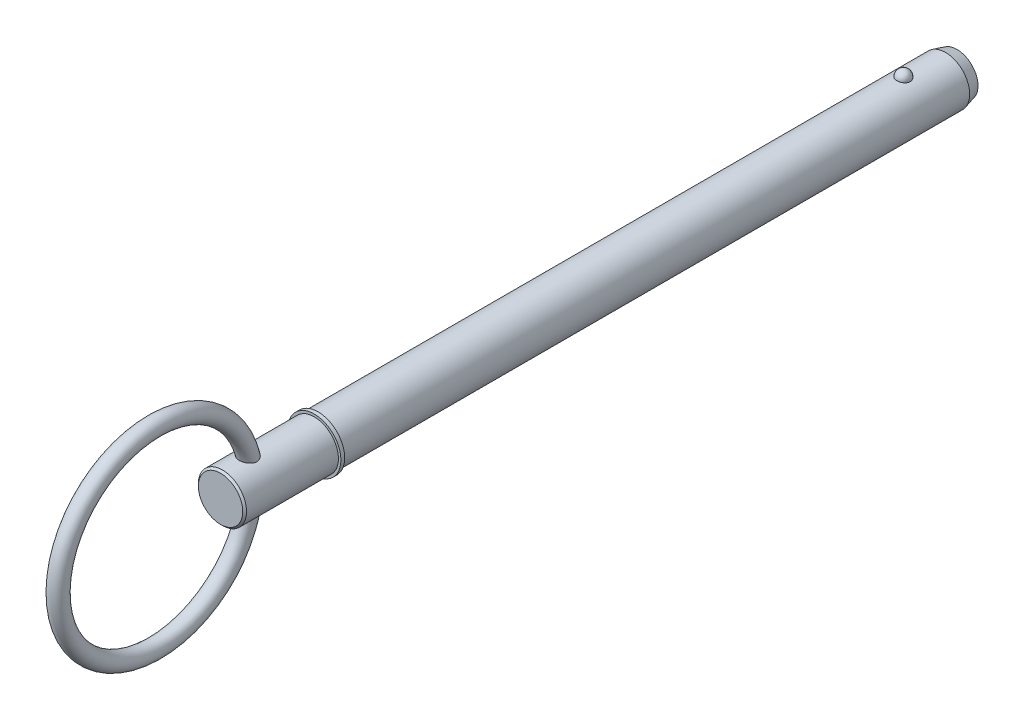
ISO-10303-21;
HEADER;
FILE_DESCRIPTION(('STEP AP214'),'2;1');
FILE_NAME('part.step','',(''),(''),'','','');
FILE_SCHEMA(('AUTOMOTIVE_DESIGN { 1 0 10303 214 1 1 1 1 }'));
ENDSEC;
DATA;
#1=APPLICATION_CONTEXT('core data for automotive mechanical design processes');
#2=APPLICATION_PROTOCOL_DEFINITION('international standard','automotive_design',2000,#1);
#3=PRODUCT_CONTEXT('',#1,'mechanical');
#4=PRODUCT('Part','Part','',(#3));
#5=PRODUCT_RELATED_PRODUCT_CATEGORY('part','',(#4));
#6=PRODUCT_DEFINITION_FORMATION('','',#4);
#7=PRODUCT_DEFINITION_CONTEXT('part definition',#1,'design');
#8=PRODUCT_DEFINITION('design','',#6,#7);
#9=PRODUCT_DEFINITION_SHAPE('','',#8);
#10=(LENGTH_UNIT() NAMED_UNIT(*) SI_UNIT(.MILLI.,.METRE.));
#11=(NAMED_UNIT(*) PLANE_ANGLE_UNIT() SI_UNIT($,.RADIAN.));
#12=(NAMED_UNIT(*) SI_UNIT($,.STERADIAN.) SOLID_ANGLE_UNIT());
#13=UNCERTAINTY_MEASURE_WITH_UNIT(LENGTH_MEASURE(1.E-05),#10,'distance_accuracy_value','');
#14=(GEOMETRIC_REPRESENTATION_CONTEXT(3) GLOBAL_UNCERTAINTY_ASSIGNED_CONTEXT((#13)) GLOBAL_UNIT_ASSIGNED_CONTEXT((#10,
#11,#12)) REPRESENTATION_CONTEXT('',''));
#15=CARTESIAN_POINT('',(0.,0.,0.));
#16=DIRECTION('',(0.,0.,1.));
#17=DIRECTION('',(1.,0.,0.));
#18=AXIS2_PLACEMENT_3D('',#15,#16,#17);
#19=CARTESIAN_POINT('',(0.,0.,152.4));
#20=DIRECTION('',(0.,0.,-1.));
#21=DIRECTION('',(-1.,0.,0.));
#22=AXIS2_PLACEMENT_3D('',#19,#20,#21);
#23=CYLINDRICAL_SURFACE('',#22,6.35);
#24=CARTESIAN_POINT('',(1.76243001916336,6.10051968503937,-1.78));
#25=CARTESIAN_POINT('',(1.76242835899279,6.10052111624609,-1.68050311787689));
#26=CARTESIAN_POINT('',(1.75431593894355,6.1028816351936,-1.58098521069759));
#27=CARTESIAN_POINT('',(1.72206027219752,6.11206037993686,-1.38476972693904));
#28=CARTESIAN_POINT('',(1.69791106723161,6.11888026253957,-1.28807321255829));
#29=CARTESIAN_POINT('',(1.63419596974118,6.13620287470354,-1.10029899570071));
#30=CARTESIAN_POINT('',(1.59463684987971,6.14670398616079,-1.00921884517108));
#31=CARTESIAN_POINT('',(1.50108569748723,6.17021534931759,-0.835161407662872));
#32=CARTESIAN_POINT('',(1.44709398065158,6.18322554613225,-0.75218394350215));
#33=CARTESIAN_POINT('',(1.3257243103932,6.21038081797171,-0.596209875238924));
#34=CARTESIAN_POINT('',(1.2582815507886,6.22453118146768,-0.523264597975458));
#35=CARTESIAN_POINT('',(1.11191624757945,6.25233390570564,-0.389855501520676));
#36=CARTESIAN_POINT('',(1.03299369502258,6.26598626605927,-0.329391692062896));
#37=CARTESIAN_POINT('',(0.866022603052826,6.29123226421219,-0.222793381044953));
#38=CARTESIAN_POINT('',(0.77800091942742,6.30283170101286,-0.176618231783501));
#39=CARTESIAN_POINT('',(0.595108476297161,6.32272058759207,-0.0996905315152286));
#40=CARTESIAN_POINT('',(0.500238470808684,6.33101040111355,-0.0689362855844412));
#41=CARTESIAN_POINT('',(0.308164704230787,6.34323464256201,-0.0241595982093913));
#42=CARTESIAN_POINT('',(0.211033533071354,6.34724467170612,-0.00984637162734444));
#43=CARTESIAN_POINT('',(0.0156629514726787,6.3507318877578,0.00262058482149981));
#44=CARTESIAN_POINT('',(-0.0825763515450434,6.35020951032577,0.000775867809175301));
#45=CARTESIAN_POINT('',(-0.275890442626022,6.34473055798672,-0.0188727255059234));
#46=CARTESIAN_POINT('',(-0.370990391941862,6.3398374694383,-0.0364481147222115));
#47=CARTESIAN_POINT('',(-0.55680531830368,6.32622723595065,-0.0867447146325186));
#48=CARTESIAN_POINT('',(-0.647520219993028,6.31751002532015,-0.119466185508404));
#49=CARTESIAN_POINT('',(-0.822606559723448,6.29711353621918,-0.199386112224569));
#50=CARTESIAN_POINT('',(-0.90693822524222,6.28541739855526,-0.246667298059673));
#51=CARTESIAN_POINT('',(-1.06646479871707,6.26032612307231,-0.354365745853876));
#52=CARTESIAN_POINT('',(-1.14165877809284,6.24693081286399,-0.414784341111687));
#53=CARTESIAN_POINT('',(-1.2823514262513,6.21959142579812,-0.548435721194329));
#54=CARTESIAN_POINT('',(-1.34763761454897,6.2056417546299,-0.621891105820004));
#55=CARTESIAN_POINT('',(-1.4651153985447,6.1789624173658,-0.778815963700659));
#56=CARTESIAN_POINT('',(-1.51730606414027,6.16623283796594,-0.86228614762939));
#57=CARTESIAN_POINT('',(-1.60782211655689,6.14325839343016,-1.03799158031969));
#58=CARTESIAN_POINT('',(-1.64598111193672,6.13304379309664,-1.1303166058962));
#59=CARTESIAN_POINT('',(-1.70661885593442,6.11644899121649,-1.32030667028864));
#60=CARTESIAN_POINT('',(-1.72909805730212,6.11006867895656,-1.41797155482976));
#61=CARTESIAN_POINT('',(-1.75775019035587,6.10188813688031,-1.61543246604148));
#62=CARTESIAN_POINT('',(-1.76399136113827,6.10006874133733,-1.71521779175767));
#63=CARTESIAN_POINT('',(-1.76020715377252,6.10116172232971,-1.91445126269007));
#64=CARTESIAN_POINT('',(-1.75018221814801,6.10407397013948,-2.01389941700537));
#65=CARTESIAN_POINT('',(-1.71421005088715,6.11427232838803,-2.20912106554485));
#66=CARTESIAN_POINT('',(-1.68834262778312,6.12153651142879,-2.30491043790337));
#67=CARTESIAN_POINT('',(-1.62139543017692,6.1396067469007,-2.49066180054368));
#68=CARTESIAN_POINT('',(-1.5803150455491,6.15041294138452,-2.58062355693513));
#69=CARTESIAN_POINT('',(-1.48369112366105,6.17443456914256,-2.75271428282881));
#70=CARTESIAN_POINT('',(-1.42806998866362,6.18766281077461,-2.83479789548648));
#71=CARTESIAN_POINT('',(-1.30386620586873,6.21501934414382,-2.98832532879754));
#72=CARTESIAN_POINT('',(-1.23528306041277,6.22914767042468,-3.05976874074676));
#73=CARTESIAN_POINT('',(-1.08663999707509,6.25679135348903,-3.19029656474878));
#74=CARTESIAN_POINT('',(-1.00653826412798,6.27030422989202,-3.24933392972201));
#75=CARTESIAN_POINT('',(-0.83721272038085,6.29514770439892,-3.35304657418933));
#76=CARTESIAN_POINT('',(-0.747989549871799,6.30647845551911,-3.39772286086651));
#77=CARTESIAN_POINT('',(-0.564098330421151,6.32556124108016,-3.47096393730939));
#78=CARTESIAN_POINT('',(-0.469512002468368,6.33335611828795,-3.49972259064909));
#79=CARTESIAN_POINT('',(-0.276633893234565,6.34470628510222,-3.54113722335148));
#80=CARTESIAN_POINT('',(-0.178342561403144,6.34826208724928,-3.55379514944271));
#81=CARTESIAN_POINT('',(0.0171660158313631,6.35071525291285,-3.56255473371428));
#82=CARTESIAN_POINT('',(0.114368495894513,6.34969931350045,-3.55896450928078));
#83=CARTESIAN_POINT('',(0.306746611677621,6.34331695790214,-3.53603383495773));
#84=CARTESIAN_POINT('',(0.401922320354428,6.33795069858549,-3.51669395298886));
#85=CARTESIAN_POINT('',(0.587203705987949,6.32347219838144,-3.4629173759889));
#86=CARTESIAN_POINT('',(0.677327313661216,6.31437430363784,-3.42853846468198));
#87=CARTESIAN_POINT('',(0.850462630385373,6.29339543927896,-3.34564128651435));
#88=CARTESIAN_POINT('',(0.933473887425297,6.2815142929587,-3.29712212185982));
#89=CARTESIAN_POINT('',(1.09144542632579,6.25601750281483,-3.18638742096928));
#90=CARTESIAN_POINT('',(1.16626195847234,6.24237795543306,-3.12397237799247));
#91=CARTESIAN_POINT('',(1.304448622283,6.21497285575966,-2.98755865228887));
#92=CARTESIAN_POINT('',(1.36781676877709,6.20120728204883,-2.91355796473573));
#93=CARTESIAN_POINT('',(1.48252779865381,6.17479923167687,-2.75456133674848));
#94=CARTESIAN_POINT('',(1.53364167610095,6.16218052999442,-2.66939613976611));
#95=CARTESIAN_POINT('',(1.62109397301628,6.13975602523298,-2.49147502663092));
#96=CARTESIAN_POINT('',(1.657437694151,6.12994921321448,-2.39872184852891));
#97=CARTESIAN_POINT('',(1.71127844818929,6.11512175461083,-2.21887622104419));
#98=CARTESIAN_POINT('',(1.73042646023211,6.10968903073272,-2.13230770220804));
#99=CARTESIAN_POINT('',(1.75600284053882,6.10238739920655,-1.95716498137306));
#100=CARTESIAN_POINT('',(1.76243149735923,6.10051841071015,-1.86859082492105));
#101=CARTESIAN_POINT('',(1.76243001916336,6.10051968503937,-1.78));
#102=B_SPLINE_CURVE_WITH_KNOTS('',3,(#24,#25,#26,#27,#28,#29,#30,#31,#32,#33,#34,#35,#36,#37,
#38,#39,#40,#41,#42,#43,#44,#45,#46,#47,#48,#49,#50,#51,#52,#53,#54,#55,#56,#57,#58,#59,#60,#61,
#62,#63,#64,#65,#66,#67,#68,#69,#70,#71,#72,#73,#74,#75,#76,#77,#78,#79,#80,#81,#82,#83,#84,#85,
#86,#87,#88,#89,#90,#91,#92,#93,#94,#95,#96,#97,#98,#99,#100,#101),.UNSPECIFIED.,.T.,.F.,(4,2,2,
2,2,2,2,2,2,2,2,2,2,2,2,2,2,2,2,2,2,2,2,2,2,2,2,2,2,2,2,2,2,2,2,2,2,2,4),(0.,0.298172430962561,
0.596455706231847,0.894608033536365,1.19275383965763,1.49237238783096,1.79199116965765,
2.09074960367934,2.38947519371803,2.68283180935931,2.97616022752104,3.26529599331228,
3.5544367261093,3.84525169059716,4.13609618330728,4.43249276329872,4.72891038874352,
5.02873757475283,5.32855610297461,5.62711261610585,5.92566100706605,6.22271765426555,
6.51978621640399,6.81847366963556,7.11717259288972,7.41698459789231,7.71677557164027,
8.01283014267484,8.30884891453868,8.59927798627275,8.88969658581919,9.17900899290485,
9.46833977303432,9.76212836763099,10.0559678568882,10.3549321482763,10.6537890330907,
10.9192841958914,11.1847733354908),.UNSPECIFIED.);
#103=CARTESIAN_POINT('',(1.76243001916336,6.10051968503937,-1.78));
#104=VERTEX_POINT('',#103);
#105=EDGE_CURVE('E102',#104,#104,#102,.T.);
#106=ORIENTED_EDGE('',*,*,#105,.T.);
#107=EDGE_LOOP('',(#106));
#108=FACE_BOUND('',#107,.T.);
#109=CARTESIAN_POINT('',(0.,0.,-12.8800000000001));
#110=DIRECTION('',(0.,0.,-1.));
#111=DIRECTION('',(-1.,0.,0.));
#112=AXIS2_PLACEMENT_3D('',#109,#110,#111);
#113=CIRCLE('',#112,6.35);
#114=CARTESIAN_POINT('',(6.35000000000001,0.,-12.8800000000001));
#115=VERTEX_POINT('',#114);
#116=EDGE_CURVE('E109',#115,#115,#113,.F.);
#117=ORIENTED_EDGE('',*,*,#116,.T.);
#118=EDGE_LOOP('',(#117));
#119=FACE_BOUND('',#118,.T.);
#120=CARTESIAN_POINT('',(0.,0.,152.4));
#121=DIRECTION('',(0.,0.,1.));
#122=DIRECTION('',(1.,0.,0.));
#123=AXIS2_PLACEMENT_3D('',#120,#121,#122);
#124=CIRCLE('',#123,6.35);
#125=CARTESIAN_POINT('',(6.35,0.,152.4));
#126=VERTEX_POINT('',#125);
#127=EDGE_CURVE('E107',#126,#126,#124,.T.);
#128=ORIENTED_EDGE('',*,*,#127,.F.);
#129=EDGE_LOOP('',(#128));
#130=FACE_BOUND('',#129,.T.);
#131=ADVANCED_FACE('F39',(#108,#119,#130),#23,.T.);
#132=CARTESIAN_POINT('',(0.,0.,-15.88));
#133=DIRECTION('',(0.,0.,-1.));
#134=DIRECTION('',(-1.,0.,0.));
#135=AXIS2_PLACEMENT_3D('',#132,#133,#134);
#136=PLANE('',#135);
#137=CARTESIAN_POINT('',(0.,0.,-15.88));
#138=DIRECTION('',(0.,0.,-1.));
#139=DIRECTION('',(-1.,0.,0.));
#140=AXIS2_PLACEMENT_3D('',#137,#138,#139);
#141=CIRCLE('',#140,5.54615242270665);
#142=CARTESIAN_POINT('',(5.54615242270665,0.,-15.88));
#143=VERTEX_POINT('',#142);
#144=EDGE_CURVE('E141',#143,#143,#141,.T.);
#145=ORIENTED_EDGE('',*,*,#144,.T.);
#146=EDGE_LOOP('',(#145));
#147=FACE_BOUND('',#146,.T.);
#148=ADVANCED_FACE('F88',(#147),#136,.T.);
#149=CARTESIAN_POINT('',(0.,0.,-15.88));
#150=DIRECTION('',(0.,0.,1.));
#151=DIRECTION('',(1.,0.,0.));
#152=AXIS2_PLACEMENT_3D('',#149,#150,#151);
#153=CONICAL_SURFACE('',#152,5.54615242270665,0.261799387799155);
#154=CARTESIAN_POINT('',(6.35000000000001,0.,-12.8800000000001));
#155=CARTESIAN_POINT('',(6.34162658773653,0.,-12.9112500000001));
#156=CARTESIAN_POINT('',(6.33325317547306,0.,-12.9425000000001));
#157=CARTESIAN_POINT('',(6.31650635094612,0.,-13.0050000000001));
#158=CARTESIAN_POINT('',(6.30813293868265,0.,-13.0362500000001));
#159=CARTESIAN_POINT('',(6.2913861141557,0.,-13.0987500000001));
#160=CARTESIAN_POINT('',(6.28301270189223,0.,-13.1300000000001));
#161=CARTESIAN_POINT('',(6.26626587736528,0.,-13.1925000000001));
#162=CARTESIAN_POINT('',(6.25789246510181,0.,-13.2237500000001));
#163=CARTESIAN_POINT('',(6.24114564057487,0.,-13.2862500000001));
#164=CARTESIAN_POINT('',(6.23277222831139,0.,-13.3175000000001));
#165=CARTESIAN_POINT('',(6.21602540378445,0.,-13.3800000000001));
#166=CARTESIAN_POINT('',(6.20765199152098,0.,-13.4112500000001));
#167=CARTESIAN_POINT('',(6.19090516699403,0.,-13.4737500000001));
#168=CARTESIAN_POINT('',(6.18253175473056,0.,-13.5050000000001));
#169=CARTESIAN_POINT('',(6.16578493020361,0.,-13.5675000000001));
#170=CARTESIAN_POINT('',(6.15741151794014,0.,-13.5987500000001));
#171=CARTESIAN_POINT('',(6.1406646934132,0.,-13.6612500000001));
#172=CARTESIAN_POINT('',(6.13229128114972,0.,-13.6925000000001));
#173=CARTESIAN_POINT('',(6.11554445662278,0.,-13.7550000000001));
#174=CARTESIAN_POINT('',(6.10717104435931,0.,-13.7862500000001));
#175=CARTESIAN_POINT('',(6.09042421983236,0.,-13.8487500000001));
#176=CARTESIAN_POINT('',(6.08205080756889,0.,-13.8800000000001));
#177=CARTESIAN_POINT('',(6.06530398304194,0.,-13.9425000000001));
#178=CARTESIAN_POINT('',(6.05693057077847,0.,-13.9737500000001));
#179=CARTESIAN_POINT('',(6.04018374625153,0.,-14.0362500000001));
#180=CARTESIAN_POINT('',(6.03181033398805,0.,-14.0675000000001));
#181=CARTESIAN_POINT('',(6.01506350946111,0.,-14.1300000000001));
#182=CARTESIAN_POINT('',(6.00669009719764,0.,-14.1612500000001));
#183=CARTESIAN_POINT('',(5.98994327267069,0.,-14.2237500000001));
#184=CARTESIAN_POINT('',(5.98156986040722,0.,-14.2550000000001));
#185=CARTESIAN_POINT('',(5.96482303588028,0.,-14.3175000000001));
#186=CARTESIAN_POINT('',(5.9564496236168,0.,-14.3487500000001));
#187=CARTESIAN_POINT('',(5.93970279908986,0.,-14.4112500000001));
#188=CARTESIAN_POINT('',(5.93132938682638,0.,-14.4425000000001));
#189=CARTESIAN_POINT('',(5.91458256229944,0.,-14.5050000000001));
#190=CARTESIAN_POINT('',(5.90620915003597,0.,-14.5362500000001));
#191=CARTESIAN_POINT('',(5.88946232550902,0.,-14.59875));
#192=CARTESIAN_POINT('',(5.88108891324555,0.,-14.63));
#193=CARTESIAN_POINT('',(5.86434208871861,0.,-14.6925));
#194=CARTESIAN_POINT('',(5.85596867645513,0.,-14.72375));
#195=CARTESIAN_POINT('',(5.83922185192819,0.,-14.78625));
#196=CARTESIAN_POINT('',(5.83084843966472,0.,-14.8175));
#197=CARTESIAN_POINT('',(5.81410161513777,0.,-14.88));
#198=CARTESIAN_POINT('',(5.8057282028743,0.,-14.91125));
#199=CARTESIAN_POINT('',(5.78898137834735,0.,-14.97375));
#200=CARTESIAN_POINT('',(5.78060796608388,0.,-15.005));
#201=CARTESIAN_POINT('',(5.76386114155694,0.,-15.0675));
#202=CARTESIAN_POINT('',(5.75548772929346,0.,-15.09875));
#203=CARTESIAN_POINT('',(5.73874090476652,0.,-15.16125));
#204=CARTESIAN_POINT('',(5.73036749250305,0.,-15.1925));
#205=CARTESIAN_POINT('',(5.7136206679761,0.,-15.255));
#206=CARTESIAN_POINT('',(5.70524725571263,0.,-15.28625));
#207=CARTESIAN_POINT('',(5.68850043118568,0.,-15.34875));
#208=CARTESIAN_POINT('',(5.68012701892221,0.,-15.38));
#209=CARTESIAN_POINT('',(5.66338019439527,0.,-15.4425));
#210=CARTESIAN_POINT('',(5.6550067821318,0.,-15.47375));
#211=CARTESIAN_POINT('',(5.63825995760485,0.,-15.53625));
#212=CARTESIAN_POINT('',(5.62988654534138,0.,-15.5675));
#213=CARTESIAN_POINT('',(5.61313972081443,0.,-15.63));
#214=CARTESIAN_POINT('',(5.60476630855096,0.,-15.66125));
#215=CARTESIAN_POINT('',(5.58801948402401,0.,-15.72375));
#216=CARTESIAN_POINT('',(5.57964607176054,0.,-15.755));
#217=CARTESIAN_POINT('',(5.5628992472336,0.,-15.8175));
#218=CARTESIAN_POINT('',(5.55452583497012,0.,-15.84875));
#219=CARTESIAN_POINT('',(5.54615242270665,0.,-15.88));
#220=B_SPLINE_CURVE_WITH_KNOTS('',3,(#154,#155,#156,#157,#158,#159,#160,#161,#162,#163,#164,
#165,#166,#167,#168,#169,#170,#171,#172,#173,#174,#175,#176,#177,#178,#179,#180,#181,#182,#183,
#184,#185,#186,#187,#188,#189,#190,#191,#192,#193,#194,#195,#196,#197,#198,#199,#200,#201,#202,
#203,#204,#205,#206,#207,#208,#209,#210,#211,#212,#213,#214,#215,#216,#217,#218,#219),
.UNSPECIFIED.,.F.,.F.,(4,2,2,2,2,2,2,2,2,2,2,2,2,2,2,2,2,2,2,2,2,2,2,2,2,2,2,2,2,2,2,2,4),(0.,
0.0970571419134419,0.194114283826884,0.291171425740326,0.388228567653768,0.485285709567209,
0.582342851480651,0.679399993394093,0.776457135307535,0.873514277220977,0.970571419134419,
1.06762856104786,1.1646857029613,1.26174284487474,1.35879998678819,1.45585712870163,
1.55291427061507,1.64997141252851,1.74702855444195,1.84408569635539,1.94114283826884,
2.03819998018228,2.13525712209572,2.23231426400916,2.3293714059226,2.42642854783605,
2.52348568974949,2.62054283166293,2.71759997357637,2.81465711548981,2.91171425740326,
3.0087713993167,3.10582854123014),.UNSPECIFIED.);
#221=EDGE_CURVE('BSEAM94',#115,#143,#220,.T.);
#222=ORIENTED_EDGE('',*,*,#116,.F.);
#223=ORIENTED_EDGE('',*,*,#144,.F.);
#224=ORIENTED_EDGE('',*,*,#221,.T.);
#225=ORIENTED_EDGE('',*,*,#221,.F.);
#226=EDGE_LOOP('',(#222,#224,#223,#225));
#227=FACE_BOUND('',#226,.T.);
#228=ADVANCED_FACE('F94',(#227),#153,.T.);
#229=CARTESIAN_POINT('',(0.,6.35,-1.78));
#230=DIRECTION('',(0.,1.,0.));
#231=DIRECTION('',(0.,0.,1.));
#232=AXIS2_PLACEMENT_3D('',#229,#230,#231);
#233=SPHERICAL_SURFACE('',#232,1.78);
#234=ORIENTED_EDGE('',*,*,#105,.F.);
#235=EDGE_LOOP('',(#234));
#236=FACE_BOUND('',#235,.T.);
#237=ADVANCED_FACE('F112',(#236),#233,.T.);
#238=CARTESIAN_POINT('',(0.,0.,152.4));
#239=DIRECTION('',(0.,0.,-1.));
#240=DIRECTION('',(-1.,0.,0.));
#241=AXIS2_PLACEMENT_3D('',#238,#239,#240);
#242=PLANE('',#241);
#243=ORIENTED_EDGE('',*,*,#127,.T.);
#244=EDGE_LOOP('',(#243));
#245=FACE_BOUND('',#244,.T.);
#246=CARTESIAN_POINT('',(0.,0.,152.4));
#247=DIRECTION('',(0.,0.,-1.));
#248=DIRECTION('',(-1.,0.,0.));
#249=AXIS2_PLACEMENT_3D('',#246,#247,#248);
#250=CIRCLE('',#249,7.);
#251=CARTESIAN_POINT('',(-7.,0.,152.4));
#252=VERTEX_POINT('',#251);
#253=EDGE_CURVE('E108',#252,#252,#250,.T.);
#254=ORIENTED_EDGE('',*,*,#253,.T.);
#255=EDGE_LOOP('',(#254));
#256=FACE_BOUND('',#255,.T.);
#257=ADVANCED_FACE('F116',(#245,#256),#242,.T.);
#258=CARTESIAN_POINT('',(0.,0.,33.7287874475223));
#259=DIRECTION('',(0.,0.,-1.));
#260=DIRECTION('',(-1.,0.,0.));
#261=AXIS2_PLACEMENT_3D('',#258,#259,#260);
#262=CYLINDRICAL_SURFACE('',#261,7.);
#263=CARTESIAN_POINT('',(0.,0.,153.4));
#264=DIRECTION('',(0.,0.,-1.));
#265=DIRECTION('',(-1.,0.,0.));
#266=AXIS2_PLACEMENT_3D('',#263,#264,#265);
#267=CIRCLE('',#266,7.);
#268=CARTESIAN_POINT('',(-7.,0.,153.4));
#269=VERTEX_POINT('',#268);
#270=EDGE_CURVE('E133',#269,#269,#267,.T.);
#271=ORIENTED_EDGE('',*,*,#270,.T.);
#272=EDGE_LOOP('',(#271));
#273=FACE_BOUND('',#272,.T.);
#274=ORIENTED_EDGE('',*,*,#253,.F.);
#275=EDGE_LOOP('',(#274));
#276=FACE_BOUND('',#275,.T.);
#277=ADVANCED_FACE('F120',(#273,#276),#262,.T.);
#278=CARTESIAN_POINT('',(0.,7.,153.4));
#279=DIRECTION('',(0.,0.,1.));
#280=DIRECTION('',(1.,0.,0.));
#281=AXIS2_PLACEMENT_3D('',#278,#279,#280);
#282=PLANE('',#281);
#283=CARTESIAN_POINT('',(0.,0.,153.4));
#284=DIRECTION('',(0.,0.,1.));
#285=DIRECTION('',(1.,0.,0.));
#286=AXIS2_PLACEMENT_3D('',#283,#284,#285);
#287=CIRCLE('',#286,6.35);
#288=CARTESIAN_POINT('',(6.35,0.,153.4));
#289=VERTEX_POINT('',#288);
#290=EDGE_CURVE('E111',#289,#289,#287,.T.);
#291=ORIENTED_EDGE('',*,*,#290,.F.);
#292=EDGE_LOOP('',(#291));
#293=FACE_BOUND('',#292,.T.);
#294=ORIENTED_EDGE('',*,*,#270,.F.);
#295=EDGE_LOOP('',(#294));
#296=FACE_BOUND('',#295,.T.);
#297=ADVANCED_FACE('F85',(#293,#296),#282,.T.);
#298=CARTESIAN_POINT('',(0.,0.,178.1));
#299=DIRECTION('',(0.,0.,-1.));
#300=DIRECTION('',(-1.,0.,0.));
#301=AXIS2_PLACEMENT_3D('',#298,#299,#300);
#302=CYLINDRICAL_SURFACE('',#301,6.35);
#303=CARTESIAN_POINT('',(-1.08120660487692,-6.25727514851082,168.85158117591));
#304=CARTESIAN_POINT('',(-0.970724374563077,-6.27636409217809,168.793879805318));
#305=CARTESIAN_POINT('',(-0.85513605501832,-6.29329984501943,168.745219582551));
#306=CARTESIAN_POINT('',(-0.616958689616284,-6.32109419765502,168.66705594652));
#307=CARTESIAN_POINT('',(-0.494369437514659,-6.3319526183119,168.63755309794));
#308=CARTESIAN_POINT('',(-0.245606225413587,-6.34647141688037,168.598367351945));
#309=CARTESIAN_POINT('',(-0.119431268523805,-6.35012977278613,168.588690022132));
#310=CARTESIAN_POINT('',(0.132849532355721,-6.34986313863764,168.589400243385));
#311=CARTESIAN_POINT('',(0.258955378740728,-6.34593843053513,168.599787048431));
#312=CARTESIAN_POINT('',(0.506912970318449,-6.33094785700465,168.640285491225));
#313=CARTESIAN_POINT('',(0.628781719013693,-6.31991516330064,168.670305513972));
#314=CARTESIAN_POINT('',(0.865486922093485,-6.29187143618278,168.749308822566));
#315=CARTESIAN_POINT('',(0.980322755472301,-6.27485987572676,168.798293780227));
#316=CARTESIAN_POINT('',(1.20050616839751,-6.23649440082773,168.914540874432));
#317=CARTESIAN_POINT('',(1.30578867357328,-6.2151135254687,168.981917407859));
#318=CARTESIAN_POINT('',(1.50311440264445,-6.17036440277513,169.133359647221));
#319=CARTESIAN_POINT('',(1.59515714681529,-6.14699608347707,169.217425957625));
#320=CARTESIAN_POINT('',(1.76326863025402,-6.1009007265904,169.400247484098));
#321=CARTESIAN_POINT('',(1.83935482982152,-6.07817301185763,169.498986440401));
#322=CARTESIAN_POINT('',(1.97338559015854,-6.03599268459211,169.708703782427));
#323=CARTESIAN_POINT('',(2.03133638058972,-6.01653894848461,169.819677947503));
#324=CARTESIAN_POINT('',(2.12591205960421,-5.98376466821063,170.047018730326));
#325=CARTESIAN_POINT('',(2.16315310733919,-5.97026970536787,170.163104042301));
#326=CARTESIAN_POINT('',(2.21830650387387,-5.94999923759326,170.400318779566));
#327=CARTESIAN_POINT('',(2.2362211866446,-5.94322292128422,170.521447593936));
#328=CARTESIAN_POINT('',(2.25273772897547,-5.93698111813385,170.763281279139));
#329=CARTESIAN_POINT('',(2.25163224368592,-5.93740484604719,170.883964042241));
#330=CARTESIAN_POINT('',(2.23167546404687,-5.94493297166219,171.123620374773));
#331=CARTESIAN_POINT('',(2.21281883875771,-5.9520393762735,171.242593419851));
#332=CARTESIAN_POINT('',(2.15679576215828,-5.97257680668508,171.483836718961));
#333=CARTESIAN_POINT('',(2.1185113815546,-5.98639144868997,171.60581287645));
#334=CARTESIAN_POINT('',(2.024702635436,-6.01876484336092,171.842284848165));
#335=CARTESIAN_POINT('',(1.96916879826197,-6.03732620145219,171.956776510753));
#336=CARTESIAN_POINT('',(1.83526629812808,-6.07945247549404,172.187995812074));
#337=CARTESIAN_POINT('',(1.75507038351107,-6.10334207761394,172.303611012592));
#338=CARTESIAN_POINT('',(1.5765788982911,-6.15186551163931,172.519894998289));
#339=CARTESIAN_POINT('',(1.47827192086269,-6.17649980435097,172.620554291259));
#340=CARTESIAN_POINT('',(1.26306696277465,-6.22410762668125,172.805023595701));
#341=CARTESIAN_POINT('',(1.14585214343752,-6.2470408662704,172.888478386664));
#342=CARTESIAN_POINT('',(0.896825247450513,-6.28760987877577,173.031400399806));
#343=CARTESIAN_POINT('',(0.765036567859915,-6.30525397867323,173.090905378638));
#344=CARTESIAN_POINT('',(0.509454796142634,-6.330648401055,173.175263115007));
#345=CARTESIAN_POINT('',(0.386964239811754,-6.33940909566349,173.203695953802));
#346=CARTESIAN_POINT('',(0.200813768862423,-6.3471308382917,173.228680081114));
#347=CARTESIAN_POINT('',(0.138353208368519,-6.34880140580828,173.234063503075));
#348=CARTESIAN_POINT('',(0.0131841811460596,-6.35029448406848,173.23887386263));
#349=CARTESIAN_POINT('',(-0.049524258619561,-6.35011719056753,173.238301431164));
#350=CARTESIAN_POINT('',(-0.219860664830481,-6.34710452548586,173.228597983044));
#351=CARTESIAN_POINT('',(-0.327176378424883,-6.34243953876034,173.213576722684));
#352=CARTESIAN_POINT('',(-0.537619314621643,-6.32808248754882,173.166673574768));
#353=CARTESIAN_POINT('',(-0.640746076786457,-6.31838987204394,173.134789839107));
#354=CARTESIAN_POINT('',(-0.841795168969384,-6.29478075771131,173.055337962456));
#355=CARTESIAN_POINT('',(-0.939631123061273,-6.28081033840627,173.00756888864));
#356=CARTESIAN_POINT('',(-1.12690564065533,-6.2499288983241,172.898513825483));
#357=CARTESIAN_POINT('',(-1.21634109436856,-6.2330167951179,172.837222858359));
#358=CARTESIAN_POINT('',(-1.39713031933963,-6.19517308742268,172.694039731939));
#359=CARTESIAN_POINT('',(-1.48711596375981,-6.17400700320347,172.610483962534));
#360=CARTESIAN_POINT('',(-1.65373642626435,-6.13148145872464,172.430996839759));
#361=CARTESIAN_POINT('',(-1.73036130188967,-6.11012186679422,172.33505636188));
#362=CARTESIAN_POINT('',(-1.87908981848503,-6.0661652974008,172.118620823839));
#363=CARTESIAN_POINT('',(-1.94902044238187,-6.04382072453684,171.996572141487));
#364=CARTESIAN_POINT('',(-2.06849605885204,-6.00398244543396,171.742070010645));
#365=CARTESIAN_POINT('',(-2.11803457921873,-5.98649027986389,171.609613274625));
#366=CARTESIAN_POINT('',(-2.19551930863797,-5.95851933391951,171.334593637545));
#367=CARTESIAN_POINT('',(-2.22297667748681,-5.94819998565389,171.191874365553));
#368=CARTESIAN_POINT('',(-2.25222139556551,-5.93719450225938,170.903480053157));
#369=CARTESIAN_POINT('',(-2.25403508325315,-5.93649848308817,170.757808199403));
#370=CARTESIAN_POINT('',(-2.23178480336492,-5.94489150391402,170.483804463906));
#371=CARTESIAN_POINT('',(-2.21035650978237,-5.95298402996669,170.355226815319));
#372=CARTESIAN_POINT('',(-2.14565882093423,-5.97660650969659,170.10440891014));
#373=CARTESIAN_POINT('',(-2.10239634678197,-5.99213410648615,169.982166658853));
#374=CARTESIAN_POINT('',(-1.99913159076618,-6.02732890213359,169.756747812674));
#375=CARTESIAN_POINT('',(-1.94060271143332,-6.0466053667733,169.652829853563));
#376=CARTESIAN_POINT('',(-1.80736340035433,-6.0877569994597,169.456534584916));
#377=CARTESIAN_POINT('',(-1.73265259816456,-6.10963222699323,169.364157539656));
#378=CARTESIAN_POINT('',(-1.56865095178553,-6.15378470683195,169.192603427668));
#379=CARTESIAN_POINT('',(-1.47928749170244,-6.17606344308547,169.113496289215));
#380=CARTESIAN_POINT('',(-1.28858731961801,-6.21864788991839,168.970675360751));
#381=CARTESIAN_POINT('',(-1.18724893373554,-6.23895332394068,168.906963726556));
#382=CARTESIAN_POINT('',(-1.08120660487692,-6.25727514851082,168.85158117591));
#383=B_SPLINE_CURVE_WITH_KNOTS('',3,(#303,#304,#305,#306,#307,#308,#309,#310,#311,#312,#313,
#314,#315,#316,#317,#318,#319,#320,#321,#322,#323,#324,#325,#326,#327,#328,#329,#330,#331,#332,
#333,#334,#335,#336,#337,#338,#339,#340,#341,#342,#343,#344,#345,#346,#347,#348,#349,#350,#351,
#352,#353,#354,#355,#356,#357,#358,#359,#360,#361,#362,#363,#364,#365,#366,#367,#368,#369,#370,
#371,#372,#373,#374,#375,#376,#377,#378,#379,#380,#381,#382),.UNSPECIFIED.,.T.,.F.,(4,2,2,2,2,2,
2,2,2,2,2,2,2,2,2,2,2,2,2,2,2,2,2,2,2,2,2,2,2,2,2,2,2,2,2,2,2,2,2,4),(0.,0.377861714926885,
0.755734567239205,1.13371352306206,1.51167842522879,1.88789208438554,2.26413891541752,
2.64278156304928,3.02143792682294,3.39967776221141,3.77778752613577,4.14394628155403,
4.51006081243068,4.87054720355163,5.23114188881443,5.61534494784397,5.99975934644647,
6.42600522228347,6.8525204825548,7.28711365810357,7.72101899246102,8.09666132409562,
8.28452949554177,8.47237776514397,8.7960795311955,9.11981678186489,9.44781545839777,
9.77593508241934,10.1483085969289,10.5209580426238,10.9463240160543,11.3718248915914,
11.8065046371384,12.2407378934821,12.6304236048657,13.0199858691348,13.3807583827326,
13.7415391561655,14.104165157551,14.4668419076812),.UNSPECIFIED.);
#384=CARTESIAN_POINT('',(-1.08120660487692,-6.25727514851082,168.85158117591));
#385=VERTEX_POINT('',#384);
#386=EDGE_CURVE('E10',#385,#385,#383,.T.);
#387=ORIENTED_EDGE('',*,*,#386,.F.);
#388=EDGE_LOOP('',(#387));
#389=FACE_BOUND('',#388,.T.);
#390=CARTESIAN_POINT('',(-1.08120660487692,6.25727514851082,168.85158117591));
#391=CARTESIAN_POINT('',(-1.19093168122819,6.23831652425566,168.908887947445));
#392=CARTESIAN_POINT('',(-1.29562751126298,6.21723224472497,168.975116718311));
#393=CARTESIAN_POINT('',(-1.49211272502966,6.17302620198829,169.124020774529));
#394=CARTESIAN_POINT('',(-1.58390200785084,6.14990442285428,169.206696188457));
#395=CARTESIAN_POINT('',(-1.75209695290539,6.10411985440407,169.386777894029));
#396=CARTESIAN_POINT('',(-1.82848346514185,6.08145766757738,169.484202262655));
#397=CARTESIAN_POINT('',(-1.96346259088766,6.0392331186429,169.691273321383));
#398=CARTESIAN_POINT('',(-2.02206050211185,6.01966983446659,169.800916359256));
#399=CARTESIAN_POINT('',(-2.11860444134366,5.9863659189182,170.026564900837));
#400=CARTESIAN_POINT('',(-2.15701637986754,5.97249571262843,170.142351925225));
#401=CARTESIAN_POINT('',(-2.21449304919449,5.95142584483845,170.379191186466));
#402=CARTESIAN_POINT('',(-2.23356015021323,5.94422536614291,170.500242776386));
#403=CARTESIAN_POINT('',(-2.25228141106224,5.93715610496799,170.741944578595));
#404=CARTESIAN_POINT('',(-2.25225786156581,5.93716560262,170.862567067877));
#405=CARTESIAN_POINT('',(-2.2344206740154,5.94389982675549,171.102277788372));
#406=CARTESIAN_POINT('',(-2.21660184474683,5.95062651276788,171.221365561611));
#407=CARTESIAN_POINT('',(-2.16272689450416,5.97042554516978,171.462705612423));
#408=CARTESIAN_POINT('',(-2.12559286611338,5.98387086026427,171.584684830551));
#409=CARTESIAN_POINT('',(-2.03409944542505,6.01558578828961,171.821342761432));
#410=CARTESIAN_POINT('',(-1.97973080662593,6.03385799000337,171.936017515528));
#411=CARTESIAN_POINT('',(-1.84828023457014,6.07549301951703,172.167865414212));
#412=CARTESIAN_POINT('',(-1.76936622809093,6.09919386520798,172.283943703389));
#413=CARTESIAN_POINT('',(-1.59344783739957,6.14749881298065,172.501420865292));
#414=CARTESIAN_POINT('',(-1.49643151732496,6.17210350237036,172.602809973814));
#415=CARTESIAN_POINT('',(-1.28333318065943,6.21994692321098,172.789508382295));
#416=CARTESIAN_POINT('',(-1.1668572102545,6.24314005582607,172.8743845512));
#417=CARTESIAN_POINT('',(-0.919062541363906,6.2843871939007,173.02034404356));
#418=CARTESIAN_POINT('',(-0.787766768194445,6.30244898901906,173.081463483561));
#419=CARTESIAN_POINT('',(-0.532335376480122,6.32876911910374,173.16911129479));
#420=CARTESIAN_POINT('',(-0.409516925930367,6.33800211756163,173.199123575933));
#421=CARTESIAN_POINT('',(-0.222636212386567,6.34640533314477,173.226338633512));
#422=CARTESIAN_POINT('',(-0.159893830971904,6.34829860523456,173.232442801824));
#423=CARTESIAN_POINT('',(-0.0340877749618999,6.35021985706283,173.23863417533));
#424=CARTESIAN_POINT('',(0.0289758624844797,6.35024804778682,173.23872206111));
#425=CARTESIAN_POINT('',(0.200008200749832,6.34776620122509,173.230732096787));
#426=CARTESIAN_POINT('',(0.307730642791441,6.34342046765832,173.21675007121));
#427=CARTESIAN_POINT('',(0.51913450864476,6.32963338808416,173.171765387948));
#428=CARTESIAN_POINT('',(0.622815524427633,6.3201915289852,173.140761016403));
#429=CARTESIAN_POINT('',(0.824580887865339,6.2970603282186,173.063086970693));
#430=CARTESIAN_POINT('',(0.922611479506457,6.28333629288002,173.016289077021));
#431=CARTESIAN_POINT('',(1.11039970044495,6.2528858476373,172.909122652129));
#432=CARTESIAN_POINT('',(1.20015435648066,6.23615836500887,172.848749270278));
#433=CARTESIAN_POINT('',(1.38155818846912,6.19866747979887,172.70760245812));
#434=CARTESIAN_POINT('',(1.47187645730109,6.17766310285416,172.625184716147));
#435=CARTESIAN_POINT('',(1.63933626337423,6.13535258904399,172.447946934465));
#436=CARTESIAN_POINT('',(1.71646809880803,6.11404624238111,172.353117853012));
#437=CARTESIAN_POINT('',(1.86660460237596,6.07002946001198,172.138851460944));
#438=CARTESIAN_POINT('',(1.93743710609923,6.04755477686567,172.017834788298));
#439=CARTESIAN_POINT('',(2.05894300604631,6.00727604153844,171.765280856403));
#440=CARTESIAN_POINT('',(2.10960917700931,5.98947366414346,171.633739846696));
#441=CARTESIAN_POINT('',(2.18982014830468,5.96062717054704,171.359758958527));
#442=CARTESIAN_POINT('',(2.21877575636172,5.94977267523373,171.217123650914));
#443=CARTESIAN_POINT('',(2.25104759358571,5.93764416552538,170.928595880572));
#444=CARTESIAN_POINT('',(2.25438985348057,5.93636042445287,170.782706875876));
#445=CARTESIAN_POINT('',(2.23498011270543,5.94368858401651,170.507731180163));
#446=CARTESIAN_POINT('',(2.21482640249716,5.95131530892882,170.378434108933));
#447=CARTESIAN_POINT('',(2.15248760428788,5.97414352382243,170.125969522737));
#448=CARTESIAN_POINT('',(2.11031020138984,5.98934237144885,170.002799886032));
#449=CARTESIAN_POINT('',(2.00904610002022,6.02402214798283,169.775783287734));
#450=CARTESIAN_POINT('',(1.95150192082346,6.04308594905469,169.671178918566));
#451=CARTESIAN_POINT('',(1.82009972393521,6.08395083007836,169.473382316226));
#452=CARTESIAN_POINT('',(1.74624088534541,6.10575204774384,169.380190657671));
#453=CARTESIAN_POINT('',(1.58309476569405,6.15008431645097,169.206164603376));
#454=CARTESIAN_POINT('',(1.49360904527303,6.17262128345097,169.125518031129));
#455=CARTESIAN_POINT('',(1.30231515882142,6.21579297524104,168.979836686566));
#456=CARTESIAN_POINT('',(1.20050521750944,6.23642742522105,168.91480416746));
#457=CARTESIAN_POINT('',(0.983786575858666,6.27432316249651,168.7998596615));
#458=CARTESIAN_POINT('',(0.868563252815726,6.29145558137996,168.750497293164));
#459=CARTESIAN_POINT('',(0.630994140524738,6.31970327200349,168.670885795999));
#460=CARTESIAN_POINT('',(0.508648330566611,6.33081852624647,168.640636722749));
#461=CARTESIAN_POINT('',(0.259933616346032,6.34590352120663,168.599879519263));
#462=CARTESIAN_POINT('',(0.133554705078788,6.34985380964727,168.589425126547));
#463=CARTESIAN_POINT('',(-0.119270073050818,6.35013815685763,168.588667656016));
#464=CARTESIAN_POINT('',(-0.245715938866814,6.34647233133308,168.598364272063));
#465=CARTESIAN_POINT('',(-0.494670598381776,6.33192772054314,168.637620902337));
#466=CARTESIAN_POINT('',(-0.617189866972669,6.3210701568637,168.667122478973));
#467=CARTESIAN_POINT('',(-0.855240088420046,6.29328476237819,168.745263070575));
#468=CARTESIAN_POINT('',(-0.970770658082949,6.27635659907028,168.793903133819));
#469=CARTESIAN_POINT('',(-1.08120660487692,6.25727514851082,168.85158117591));
#470=B_SPLINE_CURVE_WITH_KNOTS('',3,(#390,#391,#392,#393,#394,#395,#396,#397,#398,#399,#400,
#401,#402,#403,#404,#405,#406,#407,#408,#409,#410,#411,#412,#413,#414,#415,#416,#417,#418,#419,
#420,#421,#422,#423,#424,#425,#426,#427,#428,#429,#430,#431,#432,#433,#434,#435,#436,#437,#438,
#439,#440,#441,#442,#443,#444,#445,#446,#447,#448,#449,#450,#451,#452,#453,#454,#455,#456,#457,
#458,#459,#460,#461,#462,#463,#464,#465,#466,#467,#468,#469),.UNSPECIFIED.,.T.,.F.,(4,2,2,2,2,2,
2,2,2,2,2,2,2,2,2,2,2,2,2,2,2,2,2,2,2,2,2,2,2,2,2,2,2,2,2,2,2,2,2,4),(0.,0.375258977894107,
0.750520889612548,1.1262465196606,1.50186014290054,1.86837438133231,2.23484370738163,
2.59512638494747,2.95551419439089,3.33859924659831,3.7218901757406,4.14704029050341,
4.57247172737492,5.00788576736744,5.44263524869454,5.82040093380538,6.00932292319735,
6.19822354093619,6.52266071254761,6.84713055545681,7.17430063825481,7.50158780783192,
7.87233275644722,8.24334931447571,8.66748794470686,9.09177840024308,9.52720369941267,
9.96218641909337,10.3532895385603,10.7442562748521,11.1052784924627,11.4663188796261,
11.8323306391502,12.1983951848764,12.5761580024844,12.9539219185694,13.3327099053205,
13.7114921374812,14.0891615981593,14.4668517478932),.UNSPECIFIED.);
#471=CARTESIAN_POINT('',(-1.08120660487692,6.25727514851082,168.85158117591));
#472=VERTEX_POINT('',#471);
#473=EDGE_CURVE('E51',#472,#472,#470,.T.);
#474=ORIENTED_EDGE('',*,*,#473,.F.);
#475=EDGE_LOOP('',(#474));
#476=FACE_BOUND('',#475,.T.);
#477=CARTESIAN_POINT('',(0.,0.,177.6));
#478=DIRECTION('',(0.,0.,-1.));
#479=DIRECTION('',(-1.,0.,0.));
#480=AXIS2_PLACEMENT_3D('',#477,#478,#479);
#481=CIRCLE('',#480,6.35);
#482=CARTESIAN_POINT('',(-6.35,0.,177.6));
#483=VERTEX_POINT('',#482);
#484=EDGE_CURVE('E64',#483,#483,#481,.T.);
#485=ORIENTED_EDGE('',*,*,#484,.T.);
#486=EDGE_LOOP('',(#485));
#487=FACE_BOUND('',#486,.T.);
#488=ORIENTED_EDGE('',*,*,#290,.T.);
#489=EDGE_LOOP('',(#488));
#490=FACE_BOUND('',#489,.T.);
#491=ADVANCED_FACE('F69',(#389,#476,#487,#490),#302,.T.);
#492=CARTESIAN_POINT('',(0.,0.,178.1));
#493=DIRECTION('',(0.,0.,-1.));
#494=DIRECTION('',(-1.,0.,0.));
#495=AXIS2_PLACEMENT_3D('',#492,#493,#494);
#496=PLANE('',#495);
#497=CARTESIAN_POINT('',(0.,0.,178.1));
#498=DIRECTION('',(0.,0.,-1.));
#499=DIRECTION('',(-1.,0.,0.));
#500=AXIS2_PLACEMENT_3D('',#497,#498,#499);
#501=CIRCLE('',#500,5.84999999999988);
#502=CARTESIAN_POINT('',(-5.84999999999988,0.,178.1));
#503=VERTEX_POINT('',#502);
#504=EDGE_CURVE('E58',#503,#503,#501,.F.);
#505=ORIENTED_EDGE('',*,*,#504,.T.);
#506=EDGE_LOOP('',(#505));
#507=FACE_BOUND('',#506,.T.);
#508=ADVANCED_FACE('F76',(#507),#496,.F.);
#509=CARTESIAN_POINT('',(0.,0.,177.6));
#510=DIRECTION('',(0.,0.,-1.));
#511=DIRECTION('',(-1.,0.,0.));
#512=AXIS2_PLACEMENT_3D('',#509,#510,#511);
#513=CONICAL_SURFACE('',#512,6.35,0.785398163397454);
#514=ORIENTED_EDGE('',*,*,#504,.F.);
#515=EDGE_LOOP('',(#514));
#516=FACE_BOUND('',#515,.T.);
#517=ORIENTED_EDGE('',*,*,#484,.F.);
#518=EDGE_LOOP('',(#517));
#519=FACE_BOUND('',#518,.T.);
#520=ADVANCED_FACE('F41',(#516,#519),#513,.T.);
#521=CARTESIAN_POINT('',(0.,0.,195.5));
#522=DIRECTION('',(1.,0.,0.));
#523=DIRECTION('',(0.,0.,-1.));
#524=AXIS2_PLACEMENT_3D('',#521,#522,#523);
#525=TOROIDAL_SURFACE('',#524,25.4,2.25);
#526=ORIENTED_EDGE('',*,*,#386,.T.);
#527=EDGE_LOOP('',(#526));
#528=FACE_BOUND('',#527,.T.);
#529=ORIENTED_EDGE('',*,*,#473,.T.);
#530=EDGE_LOOP('',(#529));
#531=FACE_BOUND('',#530,.T.);
#532=ADVANCED_FACE('F73',(#528,#531),#525,.T.);
#533=CLOSED_SHELL('',(#131,#148,#228,#237,#257,#277,#297,#491,#508,#520,#532));
#534=MANIFOLD_SOLID_BREP('B2',#533);
#535=ADVANCED_BREP_SHAPE_REPRESENTATION('',(#18,#534),#14);
#536=SHAPE_DEFINITION_REPRESENTATION(#9,#535);
ENDSEC;
END-ISO-10303-21;
